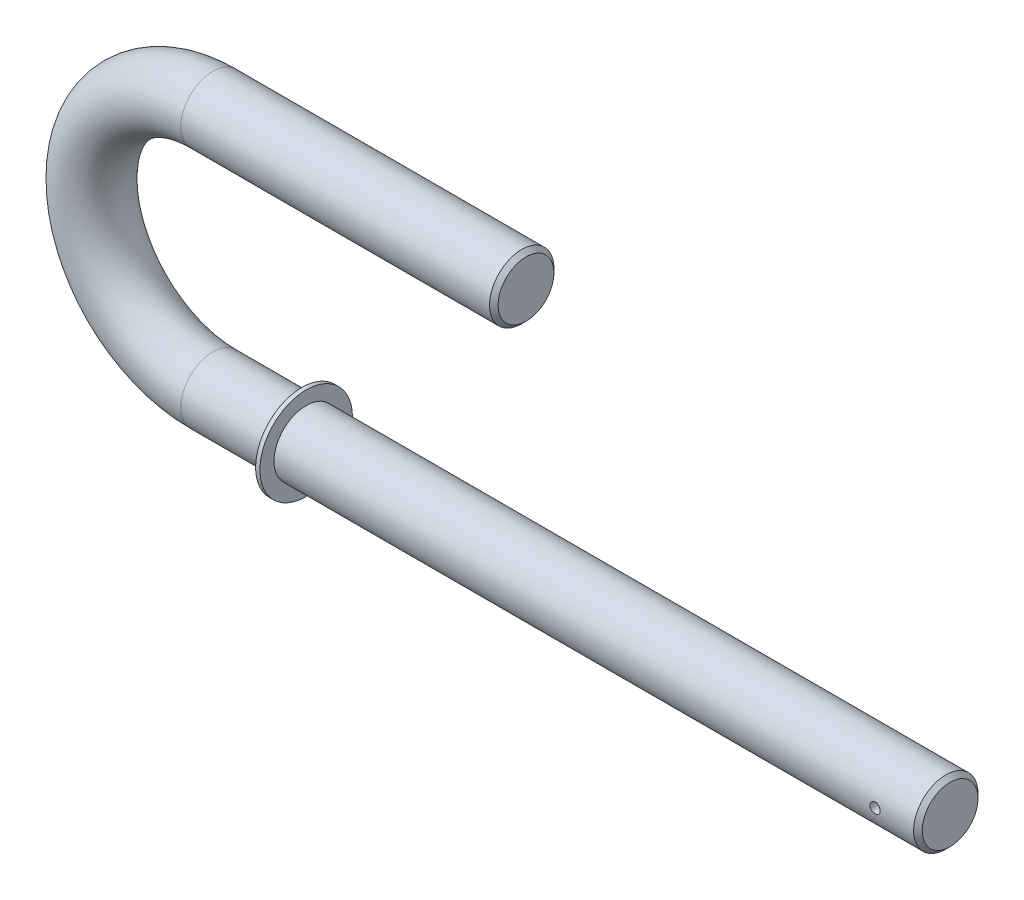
ISO-10303-21;
HEADER;
FILE_DESCRIPTION(('STEP AP214'),'2;1');
FILE_NAME('part.step','',(''),(''),'','','');
FILE_SCHEMA(('AUTOMOTIVE_DESIGN { 1 0 10303 214 1 1 1 1 }'));
ENDSEC;
DATA;
#1=APPLICATION_CONTEXT('core data for automotive mechanical design processes');
#2=APPLICATION_PROTOCOL_DEFINITION('international standard','automotive_design',2000,#1);
#3=PRODUCT_CONTEXT('',#1,'mechanical');
#4=PRODUCT('Part','Part','',(#3));
#5=PRODUCT_RELATED_PRODUCT_CATEGORY('part','',(#4));
#6=PRODUCT_DEFINITION_FORMATION('','',#4);
#7=PRODUCT_DEFINITION_CONTEXT('part definition',#1,'design');
#8=PRODUCT_DEFINITION('design','',#6,#7);
#9=PRODUCT_DEFINITION_SHAPE('','',#8);
#10=(LENGTH_UNIT() NAMED_UNIT(*) SI_UNIT(.MILLI.,.METRE.));
#11=(NAMED_UNIT(*) PLANE_ANGLE_UNIT() SI_UNIT($,.RADIAN.));
#12=(NAMED_UNIT(*) SI_UNIT($,.STERADIAN.) SOLID_ANGLE_UNIT());
#13=UNCERTAINTY_MEASURE_WITH_UNIT(LENGTH_MEASURE(1.E-05),#10,'distance_accuracy_value','');
#14=(GEOMETRIC_REPRESENTATION_CONTEXT(3) GLOBAL_UNCERTAINTY_ASSIGNED_CONTEXT((#13)) GLOBAL_UNIT_ASSIGNED_CONTEXT((#10,
#11,#12)) REPRESENTATION_CONTEXT('',''));
#15=CARTESIAN_POINT('',(0.,0.,0.));
#16=DIRECTION('',(0.,0.,1.));
#17=DIRECTION('',(1.,0.,0.));
#18=AXIS2_PLACEMENT_3D('',#15,#16,#17);
#19=CARTESIAN_POINT('',(-72.91653727,-56.6,0.));
#20=DIRECTION('',(1.,0.,0.));
#21=DIRECTION('',(0.,0.,-1.));
#22=AXIS2_PLACEMENT_3D('',#19,#20,#21);
#23=CYLINDRICAL_SURFACE('',#22,7.5);
#24=CARTESIAN_POINT('',(-72.91653727,-56.6,0.));
#25=DIRECTION('',(-1.,0.,0.));
#26=DIRECTION('',(0.,0.,-1.));
#27=AXIS2_PLACEMENT_3D('',#24,#25,#26);
#28=CIRCLE('',#27,7.5);
#29=CARTESIAN_POINT('',(-72.91653727,-64.1,0.));
#30=VERTEX_POINT('',#29);
#31=EDGE_CURVE('E99',#30,#30,#28,.T.);
#32=ORIENTED_EDGE('',*,*,#31,.F.);
#33=EDGE_LOOP('',(#32));
#34=FACE_BOUND('',#33,.T.);
#35=CARTESIAN_POINT('',(-52.21,-56.6,0.));
#36=DIRECTION('',(1.,0.,0.));
#37=DIRECTION('',(0.,0.,-1.));
#38=AXIS2_PLACEMENT_3D('',#35,#36,#37);
#39=CIRCLE('',#38,7.5);
#40=CARTESIAN_POINT('',(-52.21,-56.6,-7.5));
#41=VERTEX_POINT('',#40);
#42=EDGE_CURVE('E10',#41,#41,#39,.T.);
#43=ORIENTED_EDGE('',*,*,#42,.F.);
#44=EDGE_LOOP('',(#43));
#45=FACE_BOUND('',#44,.T.);
#46=ADVANCED_FACE('F24',(#34,#45),#23,.T.);
#47=CARTESIAN_POINT('',(-72.91653727,-28.3,0.));
#48=DIRECTION('',(0.,0.,1.));
#49=DIRECTION('',(1.,0.,0.));
#50=AXIS2_PLACEMENT_3D('',#47,#48,#49);
#51=TOROIDAL_SURFACE('',#50,28.3,7.5);
#52=CARTESIAN_POINT('',(-72.91653727,0.,0.));
#53=DIRECTION('',(1.,0.,0.));
#54=DIRECTION('',(0.,0.,-1.));
#55=AXIS2_PLACEMENT_3D('',#52,#53,#54);
#56=CIRCLE('',#55,7.5);
#57=CARTESIAN_POINT('',(-72.91653727,7.49999999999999,0.));
#58=VERTEX_POINT('',#57);
#59=EDGE_CURVE('E96',#58,#58,#56,.T.);
#60=CARTESIAN_POINT('',(-72.91653727,-28.3,0.));
#61=DIRECTION('',(0.,0.,1.));
#62=DIRECTION('',(1.,0.,0.));
#63=AXIS2_PLACEMENT_3D('',#60,#61,#62);
#64=CIRCLE('',#63,35.8);
#65=EDGE_CURVE('',#58,#30,#64,.T.);
#66=ORIENTED_EDGE('',*,*,#59,.F.);
#67=ORIENTED_EDGE('',*,*,#31,.T.);
#68=ORIENTED_EDGE('',*,*,#65,.T.);
#69=ORIENTED_EDGE('',*,*,#65,.F.);
#70=EDGE_LOOP('',(#66,#68,#67,#69));
#71=FACE_BOUND('',#70,.T.);
#72=ADVANCED_FACE('F85',(#71),#51,.T.);
#73=CARTESIAN_POINT('',(-72.91653727,0.,0.));
#74=DIRECTION('',(1.,0.,0.));
#75=DIRECTION('',(0.,1.,0.));
#76=AXIS2_PLACEMENT_3D('',#73,#74,#75);
#77=CYLINDRICAL_SURFACE('',#76,7.5);
#78=CARTESIAN_POINT('',(-0.999999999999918,0.,0.));
#79=DIRECTION('',(1.,0.,0.));
#80=DIRECTION('',(0.,1.,0.));
#81=AXIS2_PLACEMENT_3D('',#78,#79,#80);
#82=CIRCLE('',#81,7.5);
#83=CARTESIAN_POINT('',(-0.999999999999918,7.5,0.));
#84=VERTEX_POINT('',#83);
#85=EDGE_CURVE('E36',#84,#84,#82,.F.);
#86=CARTESIAN_POINT('',(-0.999999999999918,7.5,0.));
#87=CARTESIAN_POINT('',(-1.74913059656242,7.5,0.));
#88=CARTESIAN_POINT('',(-2.49826119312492,7.5,0.));
#89=CARTESIAN_POINT('',(-3.99652238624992,7.5,0.));
#90=CARTESIAN_POINT('',(-4.74565298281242,7.5,0.));
#91=CARTESIAN_POINT('',(-6.24391417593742,7.5,0.));
#92=CARTESIAN_POINT('',(-6.99304477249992,7.5,0.));
#93=CARTESIAN_POINT('',(-8.49130596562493,7.5,0.));
#94=CARTESIAN_POINT('',(-9.24043656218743,7.5,0.));
#95=CARTESIAN_POINT('',(-10.7386977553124,7.5,0.));
#96=CARTESIAN_POINT('',(-11.4878283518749,7.5,0.));
#97=CARTESIAN_POINT('',(-12.9860895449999,7.5,0.));
#98=CARTESIAN_POINT('',(-13.7352201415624,7.5,0.));
#99=CARTESIAN_POINT('',(-15.2334813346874,7.5,0.));
#100=CARTESIAN_POINT('',(-15.9826119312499,7.5,0.));
#101=CARTESIAN_POINT('',(-17.4808731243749,7.5,0.));
#102=CARTESIAN_POINT('',(-18.2300037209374,7.5,0.));
#103=CARTESIAN_POINT('',(-19.7282649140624,7.5,0.));
#104=CARTESIAN_POINT('',(-20.4773955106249,7.5,0.));
#105=CARTESIAN_POINT('',(-21.9756567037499,7.5,0.));
#106=CARTESIAN_POINT('',(-22.7247873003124,7.5,0.));
#107=CARTESIAN_POINT('',(-24.2230484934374,7.5,0.));
#108=CARTESIAN_POINT('',(-24.97217909,7.5,0.));
#109=CARTESIAN_POINT('',(-26.470440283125,7.5,0.));
#110=CARTESIAN_POINT('',(-27.2195708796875,7.5,0.));
#111=CARTESIAN_POINT('',(-28.7178320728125,7.5,0.));
#112=CARTESIAN_POINT('',(-29.466962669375,7.5,0.));
#113=CARTESIAN_POINT('',(-30.9652238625,7.5,0.));
#114=CARTESIAN_POINT('',(-31.7143544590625,7.5,0.));
#115=CARTESIAN_POINT('',(-33.2126156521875,7.5,0.));
#116=CARTESIAN_POINT('',(-33.96174624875,7.5,0.));
#117=CARTESIAN_POINT('',(-35.460007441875,7.5,0.));
#118=CARTESIAN_POINT('',(-36.2091380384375,7.5,0.));
#119=CARTESIAN_POINT('',(-37.7073992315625,7.5,0.));
#120=CARTESIAN_POINT('',(-38.456529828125,7.5,0.));
#121=CARTESIAN_POINT('',(-39.95479102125,7.5,0.));
#122=CARTESIAN_POINT('',(-40.7039216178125,7.49999999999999,0.));
#123=CARTESIAN_POINT('',(-42.2021828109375,7.49999999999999,0.));
#124=CARTESIAN_POINT('',(-42.9513134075,7.49999999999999,0.));
#125=CARTESIAN_POINT('',(-44.449574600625,7.49999999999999,0.));
#126=CARTESIAN_POINT('',(-45.1987051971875,7.49999999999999,0.));
#127=CARTESIAN_POINT('',(-46.6969663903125,7.49999999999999,0.));
#128=CARTESIAN_POINT('',(-47.446096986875,7.49999999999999,0.));
#129=CARTESIAN_POINT('',(-48.94435818,7.49999999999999,0.));
#130=CARTESIAN_POINT('',(-49.6934887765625,7.49999999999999,0.));
#131=CARTESIAN_POINT('',(-51.1917499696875,7.49999999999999,0.));
#132=CARTESIAN_POINT('',(-51.94088056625,7.49999999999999,0.));
#133=CARTESIAN_POINT('',(-53.439141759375,7.49999999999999,0.));
#134=CARTESIAN_POINT('',(-54.1882723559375,7.49999999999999,0.));
#135=CARTESIAN_POINT('',(-55.6865335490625,7.49999999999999,0.));
#136=CARTESIAN_POINT('',(-56.435664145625,7.49999999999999,0.));
#137=CARTESIAN_POINT('',(-57.93392533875,7.49999999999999,0.));
#138=CARTESIAN_POINT('',(-58.6830559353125,7.49999999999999,0.));
#139=CARTESIAN_POINT('',(-60.1813171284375,7.49999999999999,0.));
#140=CARTESIAN_POINT('',(-60.930447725,7.49999999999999,0.));
#141=CARTESIAN_POINT('',(-62.428708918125,7.49999999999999,0.));
#142=CARTESIAN_POINT('',(-63.1778395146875,7.49999999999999,0.));
#143=CARTESIAN_POINT('',(-64.6761007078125,7.49999999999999,0.));
#144=CARTESIAN_POINT('',(-65.425231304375,7.49999999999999,0.));
#145=CARTESIAN_POINT('',(-66.9234924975,7.49999999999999,0.));
#146=CARTESIAN_POINT('',(-67.6726230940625,7.49999999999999,0.));
#147=CARTESIAN_POINT('',(-69.1708842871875,7.49999999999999,0.));
#148=CARTESIAN_POINT('',(-69.92001488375,7.49999999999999,0.));
#149=CARTESIAN_POINT('',(-71.418276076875,7.49999999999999,0.));
#150=CARTESIAN_POINT('',(-72.1674066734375,7.49999999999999,0.));
#151=CARTESIAN_POINT('',(-72.91653727,7.49999999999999,0.));
#152=B_SPLINE_CURVE_WITH_KNOTS('',3,(#86,#87,#88,#89,#90,#91,#92,#93,#94,#95,#96,#97,#98,#99,
#100,#101,#102,#103,#104,#105,#106,#107,#108,#109,#110,#111,#112,#113,#114,#115,#116,#117,#118,
#119,#120,#121,#122,#123,#124,#125,#126,#127,#128,#129,#130,#131,#132,#133,#134,#135,#136,#137,
#138,#139,#140,#141,#142,#143,#144,#145,#146,#147,#148,#149,#150,#151),.UNSPECIFIED.,.F.,.F.,(4,
2,2,2,2,2,2,2,2,2,2,2,2,2,2,2,2,2,2,2,2,2,2,2,2,2,2,2,2,2,2,2,4),(0.,2.2473917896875,
4.49478357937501,6.74217536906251,8.98956715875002,11.2369589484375,13.484350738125,
15.7317425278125,17.9791343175,20.2265261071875,22.473917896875,24.7213096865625,26.96870147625,
29.2160932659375,31.463485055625,33.7108768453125,35.9582686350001,38.2056604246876,
40.4530522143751,42.7004440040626,44.9478357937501,47.1952275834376,49.4426193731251,
51.6900111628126,53.9374029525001,56.1847947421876,58.4321865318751,60.6795783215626,
62.9269701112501,65.1743619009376,67.4217536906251,69.6691454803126,71.9165372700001),.UNSPECIFIED.);
#153=EDGE_CURVE('BSEAM79',#84,#58,#152,.T.);
#154=ORIENTED_EDGE('',*,*,#85,.T.);
#155=ORIENTED_EDGE('',*,*,#59,.T.);
#156=ORIENTED_EDGE('',*,*,#153,.T.);
#157=ORIENTED_EDGE('',*,*,#153,.F.);
#158=EDGE_LOOP('',(#154,#156,#155,#157));
#159=FACE_BOUND('',#158,.T.);
#160=ADVANCED_FACE('F79',(#159),#77,.T.);
#161=CARTESIAN_POINT('',(0.,0.,0.));
#162=DIRECTION('',(1.,0.,0.));
#163=DIRECTION('',(0.,0.,-1.));
#164=AXIS2_PLACEMENT_3D('',#161,#162,#163);
#165=PLANE('',#164);
#166=CARTESIAN_POINT('',(0.,0.,0.));
#167=DIRECTION('',(1.,0.,0.));
#168=DIRECTION('',(0.,0.,-1.));
#169=AXIS2_PLACEMENT_3D('',#166,#167,#168);
#170=CIRCLE('',#169,6.50000000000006);
#171=CARTESIAN_POINT('',(0.,0.,-6.50000000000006));
#172=VERTEX_POINT('',#171);
#173=EDGE_CURVE('E41',#172,#172,#170,.T.);
#174=ORIENTED_EDGE('',*,*,#173,.T.);
#175=EDGE_LOOP('',(#174));
#176=FACE_BOUND('',#175,.T.);
#177=ADVANCED_FACE('F71',(#176),#165,.T.);
#178=CARTESIAN_POINT('',(0.,0.,0.));
#179=DIRECTION('',(-1.,0.,0.));
#180=DIRECTION('',(0.,-1.,0.));
#181=AXIS2_PLACEMENT_3D('',#178,#179,#180);
#182=CONICAL_SURFACE('',#181,6.50000000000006,0.785398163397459);
#183=ORIENTED_EDGE('',*,*,#85,.F.);
#184=EDGE_LOOP('',(#183));
#185=FACE_BOUND('',#184,.T.);
#186=ORIENTED_EDGE('',*,*,#173,.F.);
#187=EDGE_LOOP('',(#186));
#188=FACE_BOUND('',#187,.T.);
#189=ADVANCED_FACE('F63',(#185,#188),#182,.T.);
#190=CARTESIAN_POINT('',(-52.21,-56.7003450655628,0.));
#191=DIRECTION('',(1.,0.,0.));
#192=DIRECTION('',(0.,0.,-1.));
#193=AXIS2_PLACEMENT_3D('',#190,#191,#192);
#194=PLANE('',#193);
#195=CARTESIAN_POINT('',(-52.21,-56.7003450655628,0.));
#196=DIRECTION('',(1.,0.,0.));
#197=DIRECTION('',(0.,0.,-1.));
#198=AXIS2_PLACEMENT_3D('',#195,#196,#197);
#199=CIRCLE('',#198,10.7704770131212);
#200=CARTESIAN_POINT('',(-52.21,-56.7003450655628,-10.7704770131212));
#201=VERTEX_POINT('',#200);
#202=EDGE_CURVE('E129',#201,#201,#199,.T.);
#203=ORIENTED_EDGE('',*,*,#202,.F.);
#204=EDGE_LOOP('',(#203));
#205=FACE_BOUND('',#204,.T.);
#206=ORIENTED_EDGE('',*,*,#42,.T.);
#207=EDGE_LOOP('',(#206));
#208=FACE_BOUND('',#207,.T.);
#209=ADVANCED_FACE('F59',(#205,#208),#194,.F.);
#210=CARTESIAN_POINT('',(-51.21,-56.7003450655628,0.));
#211=DIRECTION('',(1.,0.,0.));
#212=DIRECTION('',(0.,0.,-1.));
#213=AXIS2_PLACEMENT_3D('',#210,#211,#212);
#214=PLANE('',#213);
#215=CARTESIAN_POINT('',(-51.21,-56.7003450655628,0.));
#216=DIRECTION('',(1.,0.,0.));
#217=DIRECTION('',(0.,0.,-1.));
#218=AXIS2_PLACEMENT_3D('',#215,#216,#217);
#219=CIRCLE('',#218,10.7704770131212);
#220=CARTESIAN_POINT('',(-51.21,-56.7003450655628,-10.7704770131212));
#221=VERTEX_POINT('',#220);
#222=EDGE_CURVE('E131',#221,#221,#219,.T.);
#223=ORIENTED_EDGE('',*,*,#222,.T.);
#224=EDGE_LOOP('',(#223));
#225=FACE_BOUND('',#224,.T.);
#226=CARTESIAN_POINT('',(-51.21,-56.6,0.));
#227=DIRECTION('',(1.,0.,0.));
#228=DIRECTION('',(0.,0.,-1.));
#229=AXIS2_PLACEMENT_3D('',#226,#227,#228);
#230=CIRCLE('',#229,7.5);
#231=CARTESIAN_POINT('',(-51.21,-56.6,-7.5));
#232=VERTEX_POINT('',#231);
#233=EDGE_CURVE('E44',#232,#232,#230,.T.);
#234=ORIENTED_EDGE('',*,*,#233,.F.);
#235=EDGE_LOOP('',(#234));
#236=FACE_BOUND('',#235,.T.);
#237=ADVANCED_FACE('F54',(#225,#236),#214,.T.);
#238=CARTESIAN_POINT('',(-52.21,-56.7003450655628,0.));
#239=DIRECTION('',(1.,0.,0.));
#240=DIRECTION('',(0.,0.,-1.));
#241=AXIS2_PLACEMENT_3D('',#238,#239,#240);
#242=CYLINDRICAL_SURFACE('',#241,10.7704770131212);
#243=ORIENTED_EDGE('',*,*,#202,.T.);
#244=EDGE_LOOP('',(#243));
#245=FACE_BOUND('',#244,.T.);
#246=ORIENTED_EDGE('',*,*,#222,.F.);
#247=EDGE_LOOP('',(#246));
#248=FACE_BOUND('',#247,.T.);
#249=ADVANCED_FACE('F58',(#245,#248),#242,.T.);
#250=CARTESIAN_POINT('',(98.78346273,-56.6,0.));
#251=DIRECTION('',(-1.,0.,0.));
#252=DIRECTION('',(0.,0.,-1.));
#253=AXIS2_PLACEMENT_3D('',#250,#251,#252);
#254=PLANE('',#253);
#255=CARTESIAN_POINT('',(98.78346273,-56.6,0.));
#256=DIRECTION('',(-1.,0.,0.));
#257=DIRECTION('',(0.,-1.,0.));
#258=AXIS2_PLACEMENT_3D('',#255,#256,#257);
#259=CIRCLE('',#258,6.50000000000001);
#260=CARTESIAN_POINT('',(98.78346273,-63.1,0.));
#261=VERTEX_POINT('',#260);
#262=EDGE_CURVE('E103',#261,#261,#259,.F.);
#263=ORIENTED_EDGE('',*,*,#262,.T.);
#264=EDGE_LOOP('',(#263));
#265=FACE_BOUND('',#264,.T.);
#266=ADVANCED_FACE('F67',(#265),#254,.F.);
#267=CARTESIAN_POINT('',(97.78346273,-56.6,0.));
#268=DIRECTION('',(-1.,0.,0.));
#269=DIRECTION('',(0.,0.,1.));
#270=AXIS2_PLACEMENT_3D('',#267,#268,#269);
#271=CONICAL_SURFACE('',#270,7.5,0.785398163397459);
#272=ORIENTED_EDGE('',*,*,#262,.F.);
#273=EDGE_LOOP('',(#272));
#274=FACE_BOUND('',#273,.T.);
#275=CARTESIAN_POINT('',(97.78346273,-56.6,0.));
#276=DIRECTION('',(-1.,0.,0.));
#277=DIRECTION('',(0.,0.,1.));
#278=AXIS2_PLACEMENT_3D('',#275,#276,#277);
#279=CIRCLE('',#278,7.5);
#280=CARTESIAN_POINT('',(97.78346273,-56.6,7.5));
#281=VERTEX_POINT('',#280);
#282=EDGE_CURVE('E100',#281,#281,#279,.T.);
#283=ORIENTED_EDGE('',*,*,#282,.F.);
#284=EDGE_LOOP('',(#283));
#285=FACE_BOUND('',#284,.T.);
#286=ADVANCED_FACE('F73',(#274,#285),#271,.T.);
#287=CARTESIAN_POINT('',(87.5834627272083,-56.6,-7.5));
#288=CARTESIAN_POINT('',(87.5834654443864,-56.6669462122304,-7.49999888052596));
#289=CARTESIAN_POINT('',(87.5890838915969,-56.7339299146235,-7.49909428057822));
#290=CARTESIAN_POINT('',(87.6114013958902,-56.8660212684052,-7.49557274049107));
#291=CARTESIAN_POINT('',(87.6281108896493,-56.9311270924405,-7.49295418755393));
#292=CARTESIAN_POINT('',(87.6720952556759,-57.0575322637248,-7.48629867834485));
#293=CARTESIAN_POINT('',(87.6993617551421,-57.1188345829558,-7.48226284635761));
#294=CARTESIAN_POINT('',(87.7636648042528,-57.2359855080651,-7.47321743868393));
#295=CARTESIAN_POINT('',(87.8007001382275,-57.2918347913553,-7.46820798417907));
#296=CARTESIAN_POINT('',(87.8838380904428,-57.3969964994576,-7.45772185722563));
#297=CARTESIAN_POINT('',(87.9300101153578,-57.4462537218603,-7.45224180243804));
#298=CARTESIAN_POINT('',(88.0299614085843,-57.5363564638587,-7.44145823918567));
#299=CARTESIAN_POINT('',(88.0837411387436,-57.5772014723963,-7.43615474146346));
#300=CARTESIAN_POINT('',(88.1977570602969,-57.6495389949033,-7.42629200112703));
#301=CARTESIAN_POINT('',(88.258027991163,-57.6809774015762,-7.42173712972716));
#302=CARTESIAN_POINT('',(88.3830801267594,-57.7332633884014,-7.41393399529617));
#303=CARTESIAN_POINT('',(88.4478610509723,-57.7541116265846,-7.4106856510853));
#304=CARTESIAN_POINT('',(88.579510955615,-57.7844525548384,-7.40589686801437));
#305=CARTESIAN_POINT('',(88.6463575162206,-57.7940402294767,-7.40434215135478));
#306=CARTESIAN_POINT('',(88.7807273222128,-57.8018822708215,-7.40307340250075));
#307=CARTESIAN_POINT('',(88.8482505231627,-57.8001373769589,-7.40335925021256));
#308=CARTESIAN_POINT('',(88.9813817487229,-57.7854412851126,-7.40572628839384));
#309=CARTESIAN_POINT('',(89.0470018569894,-57.7725964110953,-7.40779044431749));
#310=CARTESIAN_POINT('',(89.1751433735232,-57.7362316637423,-7.41345487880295));
#311=CARTESIAN_POINT('',(89.2376646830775,-57.7127114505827,-7.41705520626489));
#312=CARTESIAN_POINT('',(89.3581542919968,-57.655554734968,-7.42540489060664));
#313=CARTESIAN_POINT('',(89.4161011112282,-57.6218737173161,-7.430159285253));
#314=CARTESIAN_POINT('',(89.5255608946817,-57.5453831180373,-7.44027784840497));
#315=CARTESIAN_POINT('',(89.5770733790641,-57.5025728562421,-7.44564206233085));
#316=CARTESIAN_POINT('',(89.672818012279,-57.4084579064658,-7.45645087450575));
#317=CARTESIAN_POINT('',(89.716960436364,-57.3570619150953,-7.46189569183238));
#318=CARTESIAN_POINT('',(89.7960075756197,-57.24754422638,-7.47219556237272));
#319=CARTESIAN_POINT('',(89.8309122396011,-57.1894224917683,-7.47705061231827));
#320=CARTESIAN_POINT('',(89.8904997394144,-57.0680215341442,-7.48563003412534));
#321=CARTESIAN_POINT('',(89.9151750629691,-57.004738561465,-7.48935357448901));
#322=CARTESIAN_POINT('',(89.9535223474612,-56.8748539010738,-7.49524365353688));
#323=CARTESIAN_POINT('',(89.9671951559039,-56.8082524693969,-7.49741031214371));
#324=CARTESIAN_POINT('',(89.983028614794,-56.6743952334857,-7.49992647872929));
#325=CARTESIAN_POINT('',(89.9853125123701,-56.6071543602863,-7.50029543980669));
#326=CARTESIAN_POINT('',(89.978631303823,-56.4732503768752,-7.49922778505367));
#327=CARTESIAN_POINT('',(89.9696665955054,-56.4065872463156,-7.49779123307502));
#328=CARTESIAN_POINT('',(89.9408451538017,-56.2761087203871,-7.49328600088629));
#329=CARTESIAN_POINT('',(89.9210490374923,-56.2122795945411,-7.49022640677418));
#330=CARTESIAN_POINT('',(89.8711910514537,-56.0888462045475,-7.48281687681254));
#331=CARTESIAN_POINT('',(89.8411286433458,-56.0292421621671,-7.4784668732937));
#332=CARTESIAN_POINT('',(89.7713063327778,-55.9154128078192,-7.46891112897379));
#333=CARTESIAN_POINT('',(89.7314689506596,-55.8612355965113,-7.46369866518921));
#334=CARTESIAN_POINT('',(89.6433346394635,-55.760291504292,-7.45301757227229));
#335=CARTESIAN_POINT('',(89.595037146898,-55.7135251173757,-7.44754892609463));
#336=CARTESIAN_POINT('',(89.4908024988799,-55.6282767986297,-7.43690941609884));
#337=CARTESIAN_POINT('',(89.434797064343,-55.589877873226,-7.4317418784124));
#338=CARTESIAN_POINT('',(89.317058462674,-55.5230330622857,-7.42235046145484));
#339=CARTESIAN_POINT('',(89.2553254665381,-55.4945868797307,-7.41812655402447));
#340=CARTESIAN_POINT('',(89.1281225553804,-55.4485810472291,-7.41112524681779));
#341=CARTESIAN_POINT('',(89.0626682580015,-55.4309791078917,-7.40834223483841));
#342=CARTESIAN_POINT('',(88.9296841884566,-55.4070276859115,-7.40452339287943));
#343=CARTESIAN_POINT('',(88.8621545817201,-55.4006773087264,-7.40348742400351));
#344=CARTESIAN_POINT('',(88.7277650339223,-55.3994327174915,-7.40328562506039));
#345=CARTESIAN_POINT('',(88.6609062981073,-55.4044079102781,-7.40409847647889));
#346=CARTESIAN_POINT('',(88.5289899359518,-55.4253918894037,-7.40745616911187));
#347=CARTESIAN_POINT('',(88.4639323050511,-55.4414006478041,-7.41000100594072));
#348=CARTESIAN_POINT('',(88.3375095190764,-55.483948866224,-7.41652809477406));
#349=CARTESIAN_POINT('',(88.2761407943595,-55.5104779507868,-7.42050893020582));
#350=CARTESIAN_POINT('',(88.1587040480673,-55.5733005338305,-7.42946098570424));
#351=CARTESIAN_POINT('',(88.102636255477,-55.609594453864,-7.43443224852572));
#352=CARTESIAN_POINT('',(87.9967315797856,-55.6913860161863,-7.44487300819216));
#353=CARTESIAN_POINT('',(87.9469695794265,-55.7369800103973,-7.45034736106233));
#354=CARTESIAN_POINT('',(87.8557574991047,-55.8358739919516,-7.4611380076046));
#355=CARTESIAN_POINT('',(87.8143093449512,-55.8891757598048,-7.46645426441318));
#356=CARTESIAN_POINT('',(87.7406642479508,-56.0023709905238,-7.47636843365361));
#357=CARTESIAN_POINT('',(87.7085274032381,-56.0623039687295,-7.48096159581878));
#358=CARTESIAN_POINT('',(87.6548259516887,-56.1867648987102,-7.4888657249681));
#359=CARTESIAN_POINT('',(87.6332506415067,-56.2512881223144,-7.49217798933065));
#360=CARTESIAN_POINT('',(87.6060552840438,-56.3633986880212,-7.49641053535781));
#361=CARTESIAN_POINT('',(87.5975963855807,-56.4103019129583,-7.49774950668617));
#362=CARTESIAN_POINT('',(87.5862991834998,-56.5047971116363,-7.49954463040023));
#363=CARTESIAN_POINT('',(87.5834607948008,-56.5523890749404,-7.50000079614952));
#364=CARTESIAN_POINT('',(87.5834627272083,-56.6,-7.5));
#365=B_SPLINE_CURVE_WITH_KNOTS('',3,(#287,#288,#289,#290,#291,#292,#293,#294,#295,#296,#297,
#298,#299,#300,#301,#302,#303,#304,#305,#306,#307,#308,#309,#310,#311,#312,#313,#314,#315,#316,
#317,#318,#319,#320,#321,#322,#323,#324,#325,#326,#327,#328,#329,#330,#331,#332,#333,#334,#335,
#336,#337,#338,#339,#340,#341,#342,#343,#344,#345,#346,#347,#348,#349,#350,#351,#352,#353,#354,
#355,#356,#357,#358,#359,#360,#361,#362,#363,#364),.UNSPECIFIED.,.T.,.F.,(4,2,2,2,2,2,2,2,2,2,2,
2,2,2,2,2,2,2,2,2,2,2,2,2,2,2,2,2,2,2,2,2,2,2,2,2,2,2,4),(0.,0.200664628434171,
0.401518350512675,0.602213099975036,0.802882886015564,1.0051400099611,1.20740941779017,
1.41082086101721,1.61421966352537,1.81589015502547,2.01754748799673,2.21729434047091,
2.41704755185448,2.61768892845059,2.81834525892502,3.02128988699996,3.22423563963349,
3.42733016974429,3.63040905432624,3.83128544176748,4.03215472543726,4.23191119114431,
4.43167813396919,4.63308276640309,4.83450081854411,5.03783417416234,5.24116146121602,
5.44369072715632,5.64620389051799,5.84639375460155,6.0465831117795,6.24657552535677,
6.4465765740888,6.64876580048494,6.85100180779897,7.05451542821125,7.2578223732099,
7.40053355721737,7.54324258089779),.UNSPECIFIED.);
#366=CARTESIAN_POINT('',(87.5834627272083,-56.6,-7.5));
#367=VERTEX_POINT('',#366);
#368=EDGE_CURVE('E29',#367,#367,#365,.T.);
#369=ORIENTED_EDGE('',*,*,#368,.T.);
#370=EDGE_LOOP('',(#369));
#371=FACE_BOUND('',#370,.T.);
#372=CARTESIAN_POINT('',(89.9834627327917,-56.6,7.5));
#373=CARTESIAN_POINT('',(89.9834600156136,-56.6669462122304,7.49999888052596));
#374=CARTESIAN_POINT('',(89.9778415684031,-56.7339299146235,7.49909428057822));
#375=CARTESIAN_POINT('',(89.9555240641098,-56.8660212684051,7.49557274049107));
#376=CARTESIAN_POINT('',(89.9388145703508,-56.9311270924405,7.49295418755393));
#377=CARTESIAN_POINT('',(89.8948302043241,-57.0575322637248,7.48629867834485));
#378=CARTESIAN_POINT('',(89.8675637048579,-57.1188345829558,7.48226284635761));
#379=CARTESIAN_POINT('',(89.8032606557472,-57.2359855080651,7.47321743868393));
#380=CARTESIAN_POINT('',(89.7662253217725,-57.2918347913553,7.46820798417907));
#381=CARTESIAN_POINT('',(89.6830873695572,-57.3969964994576,7.45772185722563));
#382=CARTESIAN_POINT('',(89.6369153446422,-57.4462537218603,7.45224180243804));
#383=CARTESIAN_POINT('',(89.5369640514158,-57.5363564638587,7.44145823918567));
#384=CARTESIAN_POINT('',(89.4831843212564,-57.5772014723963,7.43615474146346));
#385=CARTESIAN_POINT('',(89.3691683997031,-57.6495389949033,7.42629200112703));
#386=CARTESIAN_POINT('',(89.308897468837,-57.6809774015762,7.42173712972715));
#387=CARTESIAN_POINT('',(89.1838453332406,-57.7332633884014,7.41393399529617));
#388=CARTESIAN_POINT('',(89.1190644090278,-57.7541116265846,7.4106856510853));
#389=CARTESIAN_POINT('',(88.987414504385,-57.7844525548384,7.40589686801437));
#390=CARTESIAN_POINT('',(88.9205679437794,-57.7940402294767,7.40434215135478));
#391=CARTESIAN_POINT('',(88.7861981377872,-57.8018822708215,7.40307340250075));
#392=CARTESIAN_POINT('',(88.7186749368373,-57.8001373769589,7.40335925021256));
#393=CARTESIAN_POINT('',(88.5855437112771,-57.7854412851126,7.40572628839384));
#394=CARTESIAN_POINT('',(88.5199236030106,-57.7725964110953,7.40779044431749));
#395=CARTESIAN_POINT('',(88.3917820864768,-57.7362316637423,7.41345487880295));
#396=CARTESIAN_POINT('',(88.3292607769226,-57.7127114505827,7.41705520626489));
#397=CARTESIAN_POINT('',(88.2087711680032,-57.655554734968,7.42540489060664));
#398=CARTESIAN_POINT('',(88.1508243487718,-57.6218737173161,7.430159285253));
#399=CARTESIAN_POINT('',(88.0413645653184,-57.5453831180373,7.44027784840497));
#400=CARTESIAN_POINT('',(87.9898520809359,-57.5025728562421,7.44564206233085));
#401=CARTESIAN_POINT('',(87.894107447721,-57.4084579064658,7.45645087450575));
#402=CARTESIAN_POINT('',(87.849965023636,-57.3570619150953,7.46189569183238));
#403=CARTESIAN_POINT('',(87.7709178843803,-57.24754422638,7.47219556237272));
#404=CARTESIAN_POINT('',(87.7360132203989,-57.1894224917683,7.47705061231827));
#405=CARTESIAN_POINT('',(87.6764257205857,-57.0680215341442,7.48563003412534));
#406=CARTESIAN_POINT('',(87.651750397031,-57.004738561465,7.48935357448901));
#407=CARTESIAN_POINT('',(87.6134031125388,-56.8748539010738,7.49524365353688));
#408=CARTESIAN_POINT('',(87.5997303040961,-56.8082524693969,7.49741031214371));
#409=CARTESIAN_POINT('',(87.5838968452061,-56.6743952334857,7.49992647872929));
#410=CARTESIAN_POINT('',(87.5816129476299,-56.6071543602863,7.50029543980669));
#411=CARTESIAN_POINT('',(87.5882941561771,-56.4732503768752,7.49922778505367));
#412=CARTESIAN_POINT('',(87.5972588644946,-56.4065872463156,7.49779123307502));
#413=CARTESIAN_POINT('',(87.6260803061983,-56.2761087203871,7.49328600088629));
#414=CARTESIAN_POINT('',(87.6458764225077,-56.2122795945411,7.49022640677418));
#415=CARTESIAN_POINT('',(87.6957344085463,-56.0888462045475,7.48281687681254));
#416=CARTESIAN_POINT('',(87.7257968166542,-56.0292421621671,7.4784668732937));
#417=CARTESIAN_POINT('',(87.7956191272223,-55.9154128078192,7.46891112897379));
#418=CARTESIAN_POINT('',(87.8354565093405,-55.8612355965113,7.46369866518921));
#419=CARTESIAN_POINT('',(87.9235908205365,-55.760291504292,7.45301757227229));
#420=CARTESIAN_POINT('',(87.9718883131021,-55.7135251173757,7.44754892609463));
#421=CARTESIAN_POINT('',(88.0761229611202,-55.6282767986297,7.43690941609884));
#422=CARTESIAN_POINT('',(88.132128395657,-55.589877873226,7.4317418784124));
#423=CARTESIAN_POINT('',(88.2498669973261,-55.5230330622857,7.42235046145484));
#424=CARTESIAN_POINT('',(88.311599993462,-55.4945868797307,7.41812655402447));
#425=CARTESIAN_POINT('',(88.4388029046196,-55.4485810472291,7.41112524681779));
#426=CARTESIAN_POINT('',(88.5042572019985,-55.4309791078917,7.40834223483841));
#427=CARTESIAN_POINT('',(88.6372412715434,-55.4070276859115,7.40452339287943));
#428=CARTESIAN_POINT('',(88.7047708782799,-55.4006773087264,7.40348742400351));
#429=CARTESIAN_POINT('',(88.8391604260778,-55.3994327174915,7.40328562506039));
#430=CARTESIAN_POINT('',(88.9060191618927,-55.4044079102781,7.40409847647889));
#431=CARTESIAN_POINT('',(89.0379355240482,-55.4253918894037,7.40745616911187));
#432=CARTESIAN_POINT('',(89.1029931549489,-55.4414006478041,7.41000100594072));
#433=CARTESIAN_POINT('',(89.2294159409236,-55.483948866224,7.41652809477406));
#434=CARTESIAN_POINT('',(89.2907846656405,-55.5104779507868,7.42050893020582));
#435=CARTESIAN_POINT('',(89.4082214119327,-55.5733005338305,7.42946098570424));
#436=CARTESIAN_POINT('',(89.464289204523,-55.609594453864,7.43443224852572));
#437=CARTESIAN_POINT('',(89.5701938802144,-55.6913860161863,7.44487300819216));
#438=CARTESIAN_POINT('',(89.6199558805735,-55.7369800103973,7.45034736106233));
#439=CARTESIAN_POINT('',(89.7111679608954,-55.8358739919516,7.4611380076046));
#440=CARTESIAN_POINT('',(89.7526161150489,-55.8891757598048,7.46645426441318));
#441=CARTESIAN_POINT('',(89.8262612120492,-56.0023709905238,7.47636843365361));
#442=CARTESIAN_POINT('',(89.8583980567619,-56.0623039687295,7.48096159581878));
#443=CARTESIAN_POINT('',(89.9120995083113,-56.1867648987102,7.4888657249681));
#444=CARTESIAN_POINT('',(89.9336748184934,-56.2512881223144,7.49217798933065));
#445=CARTESIAN_POINT('',(89.9608701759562,-56.3633986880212,7.49641053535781));
#446=CARTESIAN_POINT('',(89.9693290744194,-56.4103019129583,7.49774950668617));
#447=CARTESIAN_POINT('',(89.9806262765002,-56.5047971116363,7.49954463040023));
#448=CARTESIAN_POINT('',(89.9834646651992,-56.5523890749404,7.50000079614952));
#449=CARTESIAN_POINT('',(89.9834627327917,-56.6,7.5));
#450=B_SPLINE_CURVE_WITH_KNOTS('',3,(#372,#373,#374,#375,#376,#377,#378,#379,#380,#381,#382,
#383,#384,#385,#386,#387,#388,#389,#390,#391,#392,#393,#394,#395,#396,#397,#398,#399,#400,#401,
#402,#403,#404,#405,#406,#407,#408,#409,#410,#411,#412,#413,#414,#415,#416,#417,#418,#419,#420,
#421,#422,#423,#424,#425,#426,#427,#428,#429,#430,#431,#432,#433,#434,#435,#436,#437,#438,#439,
#440,#441,#442,#443,#444,#445,#446,#447,#448,#449),.UNSPECIFIED.,.T.,.F.,(4,2,2,2,2,2,2,2,2,2,2,
2,2,2,2,2,2,2,2,2,2,2,2,2,2,2,2,2,2,2,2,2,2,2,2,2,2,2,4),(0.,0.200664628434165,
0.401518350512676,0.60221309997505,0.802882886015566,1.00514000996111,1.20740941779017,
1.41082086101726,1.61421966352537,1.8158901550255,2.01754748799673,2.21729434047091,
2.41704755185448,2.61768892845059,2.81834525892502,3.02128988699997,3.22423563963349,
3.42733016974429,3.63040905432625,3.83128544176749,4.03215472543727,4.23191119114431,
4.4316781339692,4.63308276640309,4.83450081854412,5.03783417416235,5.24116146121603,
5.44369072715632,5.64620389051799,5.84639375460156,6.04658311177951,6.24657552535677,
6.4465765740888,6.64876580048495,6.85100180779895,7.05451542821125,7.25782237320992,
7.40053355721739,7.5432425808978),.UNSPECIFIED.);
#451=CARTESIAN_POINT('',(89.9834627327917,-56.6,7.5));
#452=VERTEX_POINT('',#451);
#453=EDGE_CURVE('E45',#452,#452,#450,.T.);
#454=ORIENTED_EDGE('',*,*,#453,.T.);
#455=EDGE_LOOP('',(#454));
#456=FACE_BOUND('',#455,.T.);
#457=ORIENTED_EDGE('',*,*,#233,.T.);
#458=EDGE_LOOP('',(#457));
#459=FACE_BOUND('',#458,.T.);
#460=ORIENTED_EDGE('',*,*,#282,.T.);
#461=EDGE_LOOP('',(#460));
#462=FACE_BOUND('',#461,.T.);
#463=ADVANCED_FACE('F26',(#371,#456,#459,#462),#23,.T.);
#464=CARTESIAN_POINT('',(88.78346273,-56.6,-10.7704770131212));
#465=DIRECTION('',(0.,0.,1.));
#466=DIRECTION('',(1.,0.,0.));
#467=AXIS2_PLACEMENT_3D('',#464,#465,#466);
#468=CYLINDRICAL_SURFACE('',#467,1.20000000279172);
#469=ORIENTED_EDGE('',*,*,#453,.F.);
#470=EDGE_LOOP('',(#469));
#471=FACE_BOUND('',#470,.T.);
#472=ORIENTED_EDGE('',*,*,#368,.F.);
#473=EDGE_LOOP('',(#472));
#474=FACE_BOUND('',#473,.T.);
#475=ADVANCED_FACE('F49',(#471,#474),#468,.F.);
#476=CLOSED_SHELL('',(#46,#72,#160,#177,#189,#209,#237,#249,#266,#286,#463,#475));
#477=MANIFOLD_SOLID_BREP('B2',#476);
#478=ADVANCED_BREP_SHAPE_REPRESENTATION('',(#18,#477),#14);
#479=SHAPE_DEFINITION_REPRESENTATION(#9,#478);
ENDSEC;
END-ISO-10303-21;
